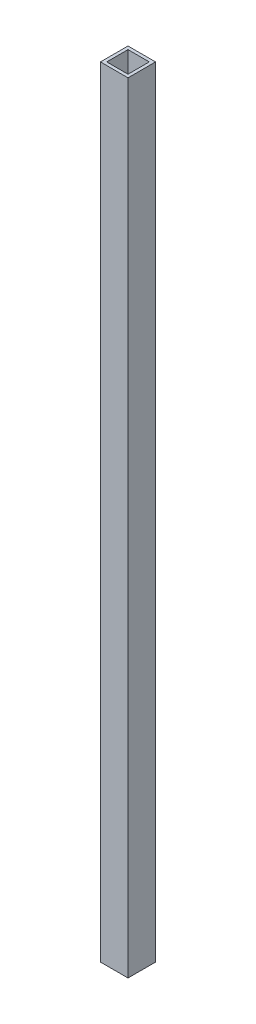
ISO-10303-21;
HEADER;
FILE_DESCRIPTION(('STEP AP214'),'2;1');
FILE_NAME('part.step','',(''),(''),'','','');
FILE_SCHEMA(('AUTOMOTIVE_DESIGN { 1 0 10303 214 1 1 1 1 }'));
ENDSEC;
DATA;
#1=APPLICATION_CONTEXT('core data for automotive mechanical design processes');
#2=APPLICATION_PROTOCOL_DEFINITION('international standard','automotive_design',2000,#1);
#3=PRODUCT_CONTEXT('',#1,'mechanical');
#4=PRODUCT('Part','Part','',(#3));
#5=PRODUCT_RELATED_PRODUCT_CATEGORY('part','',(#4));
#6=PRODUCT_DEFINITION_FORMATION('','',#4);
#7=PRODUCT_DEFINITION_CONTEXT('part definition',#1,'design');
#8=PRODUCT_DEFINITION('design','',#6,#7);
#9=PRODUCT_DEFINITION_SHAPE('','',#8);
#10=(LENGTH_UNIT() NAMED_UNIT(*) SI_UNIT(.MILLI.,.METRE.));
#11=(NAMED_UNIT(*) PLANE_ANGLE_UNIT() SI_UNIT($,.RADIAN.));
#12=(NAMED_UNIT(*) SI_UNIT($,.STERADIAN.) SOLID_ANGLE_UNIT());
#13=UNCERTAINTY_MEASURE_WITH_UNIT(LENGTH_MEASURE(1.E-05),#10,'distance_accuracy_value','');
#14=(GEOMETRIC_REPRESENTATION_CONTEXT(3) GLOBAL_UNCERTAINTY_ASSIGNED_CONTEXT((#13)) GLOBAL_UNIT_ASSIGNED_CONTEXT((#10,
#11,#12)) REPRESENTATION_CONTEXT('',''));
#15=CARTESIAN_POINT('',(0.,0.,0.));
#16=DIRECTION('',(0.,0.,1.));
#17=DIRECTION('',(1.,0.,0.));
#18=AXIS2_PLACEMENT_3D('',#15,#16,#17);
#19=CARTESIAN_POINT('',(13.25,750.,-13.25));
#20=DIRECTION('',(0.,-1.,0.));
#21=DIRECTION('',(0.,0.,-1.));
#22=AXIS2_PLACEMENT_3D('',#19,#20,#21);
#23=PLANE('',#22);
#24=DIRECTION('',(0.,0.,-1.));
#25=VECTOR('',#24,1.);
#26=CARTESIAN_POINT('',(13.25,750.,13.25));
#27=LINE('',#26,#25);
#28=CARTESIAN_POINT('',(13.25,750.,13.25));
#29=VERTEX_POINT('',#28);
#30=CARTESIAN_POINT('',(13.25,750.,-13.25));
#31=VERTEX_POINT('',#30);
#32=EDGE_CURVE('E136',#29,#31,#27,.T.);
#33=ORIENTED_EDGE('',*,*,#32,.T.);
#34=DIRECTION('',(-1.,0.,0.));
#35=VECTOR('',#34,1.);
#36=CARTESIAN_POINT('',(-13.25,750.,-13.25));
#37=LINE('',#36,#35);
#38=CARTESIAN_POINT('',(-13.25,750.,-13.25));
#39=VERTEX_POINT('',#38);
#40=EDGE_CURVE('E139',#31,#39,#37,.T.);
#41=ORIENTED_EDGE('',*,*,#40,.T.);
#42=DIRECTION('',(0.,0.,1.));
#43=VECTOR('',#42,1.);
#44=CARTESIAN_POINT('',(-13.25,750.,13.25));
#45=LINE('',#44,#43);
#46=CARTESIAN_POINT('',(-13.25,750.,13.25));
#47=VERTEX_POINT('',#46);
#48=EDGE_CURVE('E142',#39,#47,#45,.T.);
#49=ORIENTED_EDGE('',*,*,#48,.T.);
#50=DIRECTION('',(1.,0.,0.));
#51=VECTOR('',#50,1.);
#52=CARTESIAN_POINT('',(-13.25,750.,13.25));
#53=LINE('',#52,#51);
#54=EDGE_CURVE('E144',#47,#29,#53,.T.);
#55=ORIENTED_EDGE('',*,*,#54,.T.);
#56=EDGE_LOOP('',(#33,#41,#49,#55));
#57=FACE_BOUND('',#56,.T.);
#58=DIRECTION('',(0.,0.,-1.));
#59=VECTOR('',#58,1.);
#60=CARTESIAN_POINT('',(10.25,750.,10.25));
#61=LINE('',#60,#59);
#62=CARTESIAN_POINT('',(10.25,750.,10.25));
#63=VERTEX_POINT('',#62);
#64=CARTESIAN_POINT('',(10.25,750.,-10.25));
#65=VERTEX_POINT('',#64);
#66=EDGE_CURVE('E98',#63,#65,#61,.T.);
#67=ORIENTED_EDGE('',*,*,#66,.F.);
#68=DIRECTION('',(1.,0.,0.));
#69=VECTOR('',#68,1.);
#70=CARTESIAN_POINT('',(-10.25,750.,10.25));
#71=LINE('',#70,#69);
#72=CARTESIAN_POINT('',(-10.25,750.,10.25));
#73=VERTEX_POINT('',#72);
#74=EDGE_CURVE('E120',#73,#63,#71,.T.);
#75=ORIENTED_EDGE('',*,*,#74,.F.);
#76=DIRECTION('',(0.,0.,1.));
#77=VECTOR('',#76,1.);
#78=CARTESIAN_POINT('',(-10.25,750.,10.25));
#79=LINE('',#78,#77);
#80=CARTESIAN_POINT('',(-10.25,750.,-10.25));
#81=VERTEX_POINT('',#80);
#82=EDGE_CURVE('E118',#81,#73,#79,.T.);
#83=ORIENTED_EDGE('',*,*,#82,.F.);
#84=DIRECTION('',(-1.,0.,0.));
#85=VECTOR('',#84,1.);
#86=CARTESIAN_POINT('',(-10.25,750.,-10.25));
#87=LINE('',#86,#85);
#88=EDGE_CURVE('E106',#65,#81,#87,.T.);
#89=ORIENTED_EDGE('',*,*,#88,.F.);
#90=EDGE_LOOP('',(#67,#75,#83,#89));
#91=FACE_BOUND('',#90,.T.);
#92=ADVANCED_FACE('F33',(#57,#91),#23,.F.);
#93=CARTESIAN_POINT('',(13.25,0.,-13.25));
#94=DIRECTION('',(0.,-1.,0.));
#95=DIRECTION('',(0.,0.,-1.));
#96=AXIS2_PLACEMENT_3D('',#93,#94,#95);
#97=PLANE('',#96);
#98=DIRECTION('',(0.,0.,-1.));
#99=VECTOR('',#98,1.);
#100=CARTESIAN_POINT('',(13.25,0.,13.25));
#101=LINE('',#100,#99);
#102=CARTESIAN_POINT('',(13.25,0.,13.25));
#103=VERTEX_POINT('',#102);
#104=CARTESIAN_POINT('',(13.25,0.,-13.25));
#105=VERTEX_POINT('',#104);
#106=EDGE_CURVE('E114',#103,#105,#101,.T.);
#107=ORIENTED_EDGE('',*,*,#106,.F.);
#108=DIRECTION('',(1.,0.,0.));
#109=VECTOR('',#108,1.);
#110=CARTESIAN_POINT('',(-13.25,0.,13.25));
#111=LINE('',#110,#109);
#112=CARTESIAN_POINT('',(-13.25,0.,13.25));
#113=VERTEX_POINT('',#112);
#114=EDGE_CURVE('E140',#113,#103,#111,.T.);
#115=ORIENTED_EDGE('',*,*,#114,.F.);
#116=DIRECTION('',(0.,0.,1.));
#117=VECTOR('',#116,1.);
#118=CARTESIAN_POINT('',(-13.25,0.,13.25));
#119=LINE('',#118,#117);
#120=CARTESIAN_POINT('',(-13.25,0.,-13.25));
#121=VERTEX_POINT('',#120);
#122=EDGE_CURVE('E151',#121,#113,#119,.T.);
#123=ORIENTED_EDGE('',*,*,#122,.F.);
#124=DIRECTION('',(-1.,0.,0.));
#125=VECTOR('',#124,1.);
#126=CARTESIAN_POINT('',(-13.25,0.,-13.25));
#127=LINE('',#126,#125);
#128=EDGE_CURVE('E149',#105,#121,#127,.T.);
#129=ORIENTED_EDGE('',*,*,#128,.F.);
#130=EDGE_LOOP('',(#107,#115,#123,#129));
#131=FACE_BOUND('',#130,.T.);
#132=DIRECTION('',(1.,0.,0.));
#133=VECTOR('',#132,1.);
#134=CARTESIAN_POINT('',(-10.25,0.,10.25));
#135=LINE('',#134,#133);
#136=CARTESIAN_POINT('',(-10.25,0.,10.25));
#137=VERTEX_POINT('',#136);
#138=CARTESIAN_POINT('',(10.25,0.,10.25));
#139=VERTEX_POINT('',#138);
#140=EDGE_CURVE('E107',#137,#139,#135,.T.);
#141=ORIENTED_EDGE('',*,*,#140,.T.);
#142=DIRECTION('',(0.,0.,-1.));
#143=VECTOR('',#142,1.);
#144=CARTESIAN_POINT('',(10.25,0.,10.25));
#145=LINE('',#144,#143);
#146=CARTESIAN_POINT('',(10.25,0.,-10.25));
#147=VERTEX_POINT('',#146);
#148=EDGE_CURVE('E56',#139,#147,#145,.T.);
#149=ORIENTED_EDGE('',*,*,#148,.T.);
#150=DIRECTION('',(-1.,0.,0.));
#151=VECTOR('',#150,1.);
#152=CARTESIAN_POINT('',(-10.25,0.,-10.25));
#153=LINE('',#152,#151);
#154=CARTESIAN_POINT('',(-10.25,0.,-10.25));
#155=VERTEX_POINT('',#154);
#156=EDGE_CURVE('E113',#147,#155,#153,.T.);
#157=ORIENTED_EDGE('',*,*,#156,.T.);
#158=DIRECTION('',(0.,0.,1.));
#159=VECTOR('',#158,1.);
#160=CARTESIAN_POINT('',(-10.25,0.,10.25));
#161=LINE('',#160,#159);
#162=EDGE_CURVE('E128',#155,#137,#161,.T.);
#163=ORIENTED_EDGE('',*,*,#162,.T.);
#164=EDGE_LOOP('',(#141,#149,#157,#163));
#165=FACE_BOUND('',#164,.T.);
#166=ADVANCED_FACE('F169',(#131,#165),#97,.T.);
#167=CARTESIAN_POINT('',(13.25,750.,13.25));
#168=DIRECTION('',(-1.,0.,0.));
#169=DIRECTION('',(0.,0.,1.));
#170=AXIS2_PLACEMENT_3D('',#167,#168,#169);
#171=PLANE('',#170);
#172=ORIENTED_EDGE('',*,*,#106,.T.);
#173=DIRECTION('',(0.,-1.,0.));
#174=VECTOR('',#173,1.);
#175=CARTESIAN_POINT('',(13.25,750.,-13.25));
#176=LINE('',#175,#174);
#177=EDGE_CURVE('E11',#31,#105,#176,.T.);
#178=ORIENTED_EDGE('',*,*,#177,.F.);
#179=ORIENTED_EDGE('',*,*,#32,.F.);
#180=DIRECTION('',(0.,-1.,0.));
#181=VECTOR('',#180,1.);
#182=CARTESIAN_POINT('',(13.25,750.,13.25));
#183=LINE('',#182,#181);
#184=EDGE_CURVE('E146',#29,#103,#183,.T.);
#185=ORIENTED_EDGE('',*,*,#184,.T.);
#186=EDGE_LOOP('',(#172,#178,#179,#185));
#187=FACE_BOUND('',#186,.T.);
#188=ADVANCED_FACE('F35',(#187),#171,.F.);
#189=CARTESIAN_POINT('',(-13.25,750.,-13.25));
#190=DIRECTION('',(0.,0.,1.));
#191=DIRECTION('',(1.,0.,0.));
#192=AXIS2_PLACEMENT_3D('',#189,#190,#191);
#193=PLANE('',#192);
#194=CARTESIAN_POINT('',(0.,40.,-13.25));
#195=DIRECTION('',(0.,0.,-1.));
#196=DIRECTION('',(-1.,0.,0.));
#197=AXIS2_PLACEMENT_3D('',#194,#195,#196);
#198=CIRCLE('',#197,1.89864999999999);
#199=CARTESIAN_POINT('',(-1.89864999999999,40.,-13.25));
#200=VERTEX_POINT('',#199);
#201=EDGE_CURVE('E231',#200,#200,#198,.T.);
#202=ORIENTED_EDGE('',*,*,#201,.F.);
#203=EDGE_LOOP('',(#202));
#204=FACE_BOUND('',#203,.T.);
#205=CARTESIAN_POINT('',(0.,90.,-13.25));
#206=DIRECTION('',(0.,0.,-1.));
#207=DIRECTION('',(-1.,0.,0.));
#208=AXIS2_PLACEMENT_3D('',#205,#206,#207);
#209=CIRCLE('',#208,1.89864999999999);
#210=CARTESIAN_POINT('',(-1.89864999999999,90.,-13.25));
#211=VERTEX_POINT('',#210);
#212=EDGE_CURVE('E233',#211,#211,#209,.T.);
#213=ORIENTED_EDGE('',*,*,#212,.F.);
#214=EDGE_LOOP('',(#213));
#215=FACE_BOUND('',#214,.T.);
#216=ORIENTED_EDGE('',*,*,#128,.T.);
#217=DIRECTION('',(0.,-1.,0.));
#218=VECTOR('',#217,1.);
#219=CARTESIAN_POINT('',(-13.25,750.,-13.25));
#220=LINE('',#219,#218);
#221=EDGE_CURVE('E41',#39,#121,#220,.T.);
#222=ORIENTED_EDGE('',*,*,#221,.F.);
#223=ORIENTED_EDGE('',*,*,#40,.F.);
#224=ORIENTED_EDGE('',*,*,#177,.T.);
#225=EDGE_LOOP('',(#216,#222,#223,#224));
#226=FACE_BOUND('',#225,.T.);
#227=ADVANCED_FACE('F179',(#204,#215,#226),#193,.F.);
#228=CARTESIAN_POINT('',(-13.25,750.,13.25));
#229=DIRECTION('',(1.,0.,0.));
#230=DIRECTION('',(0.,0.,-1.));
#231=AXIS2_PLACEMENT_3D('',#228,#229,#230);
#232=PLANE('',#231);
#233=ORIENTED_EDGE('',*,*,#122,.T.);
#234=DIRECTION('',(0.,-1.,0.));
#235=VECTOR('',#234,1.);
#236=CARTESIAN_POINT('',(-13.25,750.,13.25));
#237=LINE('',#236,#235);
#238=EDGE_CURVE('E156',#47,#113,#237,.T.);
#239=ORIENTED_EDGE('',*,*,#238,.F.);
#240=ORIENTED_EDGE('',*,*,#48,.F.);
#241=ORIENTED_EDGE('',*,*,#221,.T.);
#242=EDGE_LOOP('',(#233,#239,#240,#241));
#243=FACE_BOUND('',#242,.T.);
#244=ADVANCED_FACE('F163',(#243),#232,.F.);
#245=CARTESIAN_POINT('',(-13.25,750.,13.25));
#246=DIRECTION('',(0.,0.,-1.));
#247=DIRECTION('',(-1.,0.,0.));
#248=AXIS2_PLACEMENT_3D('',#245,#246,#247);
#249=PLANE('',#248);
#250=ORIENTED_EDGE('',*,*,#114,.T.);
#251=ORIENTED_EDGE('',*,*,#184,.F.);
#252=ORIENTED_EDGE('',*,*,#54,.F.);
#253=ORIENTED_EDGE('',*,*,#238,.T.);
#254=EDGE_LOOP('',(#250,#251,#252,#253));
#255=FACE_BOUND('',#254,.T.);
#256=ADVANCED_FACE('F173',(#255),#249,.F.);
#257=CARTESIAN_POINT('',(10.25,750.,10.25));
#258=DIRECTION('',(-1.,0.,0.));
#259=DIRECTION('',(0.,0.,1.));
#260=AXIS2_PLACEMENT_3D('',#257,#258,#259);
#261=PLANE('',#260);
#262=ORIENTED_EDGE('',*,*,#148,.F.);
#263=DIRECTION('',(0.,-1.,0.));
#264=VECTOR('',#263,1.);
#265=CARTESIAN_POINT('',(10.25,750.,10.25));
#266=LINE('',#265,#264);
#267=EDGE_CURVE('E102',#63,#139,#266,.T.);
#268=ORIENTED_EDGE('',*,*,#267,.F.);
#269=ORIENTED_EDGE('',*,*,#66,.T.);
#270=DIRECTION('',(0.,-1.,0.));
#271=VECTOR('',#270,1.);
#272=CARTESIAN_POINT('',(10.25,750.,-10.25));
#273=LINE('',#272,#271);
#274=EDGE_CURVE('E101',#65,#147,#273,.T.);
#275=ORIENTED_EDGE('',*,*,#274,.T.);
#276=EDGE_LOOP('',(#262,#268,#269,#275));
#277=FACE_BOUND('',#276,.T.);
#278=ADVANCED_FACE('F100',(#277),#261,.T.);
#279=CARTESIAN_POINT('',(-10.25,750.,-10.25));
#280=DIRECTION('',(0.,0.,1.));
#281=DIRECTION('',(1.,0.,0.));
#282=AXIS2_PLACEMENT_3D('',#279,#280,#281);
#283=PLANE('',#282);
#284=CARTESIAN_POINT('',(0.,40.,-10.25));
#285=DIRECTION('',(0.,0.,1.));
#286=DIRECTION('',(1.,0.,0.));
#287=AXIS2_PLACEMENT_3D('',#284,#285,#286);
#288=CIRCLE('',#287,1.89864999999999);
#289=CARTESIAN_POINT('',(1.89864999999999,40.,-10.25));
#290=VERTEX_POINT('',#289);
#291=EDGE_CURVE('E229',#290,#290,#288,.T.);
#292=ORIENTED_EDGE('',*,*,#291,.F.);
#293=EDGE_LOOP('',(#292));
#294=FACE_BOUND('',#293,.T.);
#295=CARTESIAN_POINT('',(0.,90.,-10.25));
#296=DIRECTION('',(0.,0.,1.));
#297=DIRECTION('',(1.,0.,0.));
#298=AXIS2_PLACEMENT_3D('',#295,#296,#297);
#299=CIRCLE('',#298,1.89864999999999);
#300=CARTESIAN_POINT('',(1.89864999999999,90.,-10.25));
#301=VERTEX_POINT('',#300);
#302=EDGE_CURVE('E126',#301,#301,#299,.T.);
#303=ORIENTED_EDGE('',*,*,#302,.F.);
#304=EDGE_LOOP('',(#303));
#305=FACE_BOUND('',#304,.T.);
#306=ORIENTED_EDGE('',*,*,#156,.F.);
#307=ORIENTED_EDGE('',*,*,#274,.F.);
#308=ORIENTED_EDGE('',*,*,#88,.T.);
#309=DIRECTION('',(0.,-1.,0.));
#310=VECTOR('',#309,1.);
#311=CARTESIAN_POINT('',(-10.25,750.,-10.25));
#312=LINE('',#311,#310);
#313=EDGE_CURVE('E115',#81,#155,#312,.T.);
#314=ORIENTED_EDGE('',*,*,#313,.T.);
#315=EDGE_LOOP('',(#306,#307,#308,#314));
#316=FACE_BOUND('',#315,.T.);
#317=ADVANCED_FACE('F110',(#294,#305,#316),#283,.T.);
#318=CARTESIAN_POINT('',(-10.25,750.,10.25));
#319=DIRECTION('',(1.,0.,0.));
#320=DIRECTION('',(0.,0.,-1.));
#321=AXIS2_PLACEMENT_3D('',#318,#319,#320);
#322=PLANE('',#321);
#323=ORIENTED_EDGE('',*,*,#162,.F.);
#324=ORIENTED_EDGE('',*,*,#313,.F.);
#325=ORIENTED_EDGE('',*,*,#82,.T.);
#326=DIRECTION('',(0.,-1.,0.));
#327=VECTOR('',#326,1.);
#328=CARTESIAN_POINT('',(-10.25,750.,10.25));
#329=LINE('',#328,#327);
#330=EDGE_CURVE('E48',#73,#137,#329,.T.);
#331=ORIENTED_EDGE('',*,*,#330,.T.);
#332=EDGE_LOOP('',(#323,#324,#325,#331));
#333=FACE_BOUND('',#332,.T.);
#334=ADVANCED_FACE('F205',(#333),#322,.T.);
#335=CARTESIAN_POINT('',(-10.25,750.,10.25));
#336=DIRECTION('',(0.,0.,-1.));
#337=DIRECTION('',(-1.,0.,0.));
#338=AXIS2_PLACEMENT_3D('',#335,#336,#337);
#339=PLANE('',#338);
#340=ORIENTED_EDGE('',*,*,#140,.F.);
#341=ORIENTED_EDGE('',*,*,#330,.F.);
#342=ORIENTED_EDGE('',*,*,#74,.T.);
#343=ORIENTED_EDGE('',*,*,#267,.T.);
#344=EDGE_LOOP('',(#340,#341,#342,#343));
#345=FACE_BOUND('',#344,.T.);
#346=ADVANCED_FACE('F210',(#345),#339,.T.);
#347=CARTESIAN_POINT('',(0.,90.,-13.25));
#348=DIRECTION('',(0.,0.,-1.));
#349=DIRECTION('',(-1.,0.,0.));
#350=AXIS2_PLACEMENT_3D('',#347,#348,#349);
#351=CYLINDRICAL_SURFACE('',#350,1.89864999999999);
#352=ORIENTED_EDGE('',*,*,#302,.T.);
#353=EDGE_LOOP('',(#352));
#354=FACE_BOUND('',#353,.T.);
#355=ORIENTED_EDGE('',*,*,#212,.T.);
#356=EDGE_LOOP('',(#355));
#357=FACE_BOUND('',#356,.T.);
#358=ADVANCED_FACE('F218',(#354,#357),#351,.F.);
#359=CARTESIAN_POINT('',(0.,40.,-13.25));
#360=DIRECTION('',(0.,0.,-1.));
#361=DIRECTION('',(-1.,0.,0.));
#362=AXIS2_PLACEMENT_3D('',#359,#360,#361);
#363=CYLINDRICAL_SURFACE('',#362,1.89864999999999);
#364=ORIENTED_EDGE('',*,*,#291,.T.);
#365=EDGE_LOOP('',(#364));
#366=FACE_BOUND('',#365,.T.);
#367=ORIENTED_EDGE('',*,*,#201,.T.);
#368=EDGE_LOOP('',(#367));
#369=FACE_BOUND('',#368,.T.);
#370=ADVANCED_FACE('F221',(#366,#369),#363,.F.);
#371=CLOSED_SHELL('',(#92,#166,#188,#227,#244,#256,#278,#317,#334,#346,#358,#370));
#372=MANIFOLD_SOLID_BREP('B2',#371);
#373=ADVANCED_BREP_SHAPE_REPRESENTATION('',(#18,#372),#14);
#374=SHAPE_DEFINITION_REPRESENTATION(#9,#373);
ENDSEC;
END-ISO-10303-21;
